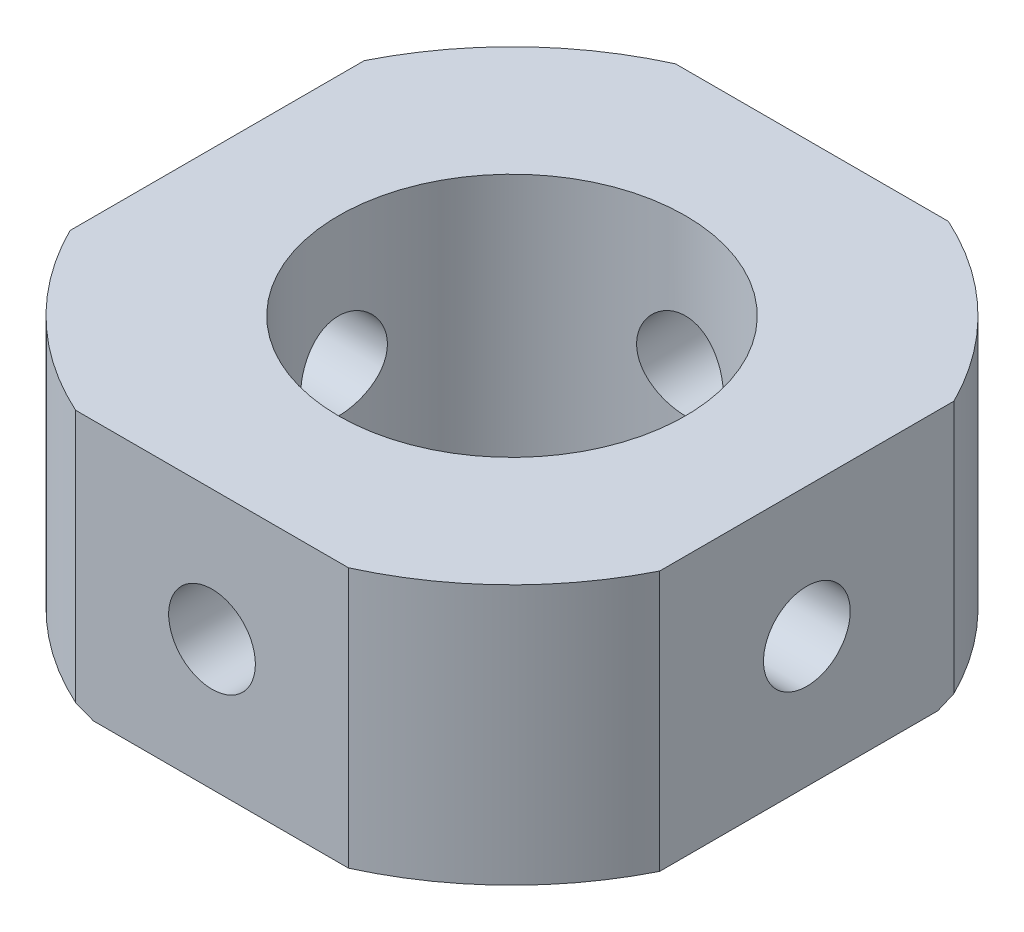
from build123d import *

# Parameters (mm, degrees)
SKETCH_1_R           = 9.5
EXTRUDE_1_DEPTH      = 3.75
SKETCH_2_R           = 5
CUT_EXTRUDE_1_DEPTH  = 16.386682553
SKETCH_3_OUTSIDE_W   = 26.58
SKETCH_3_OUTSIDE_H   = 26.58
SKETCH_3_OUTSIDE_W_2 = 17
SKETCH_3_OUTSIDE_H_2 = 17.295331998
CUT_EXTRUDE_2_DEPTH  = 16.386682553
HOLE_WIZARD_M3_1_D   = 2.5
CHAMFER_2_SIZE       = 0.2
HOLE_WIZARD_M3_2_D   = 2.5


with BuildPart() as part:
    # Sketch 1 → Extrude 1 (new, symmetric)
    with BuildSketch(Plane(origin=(0, 0, 0), x_dir=(1, 0, 0), z_dir=(0, 1, 0))):
        with Locations(Location((0, 0, 0), (0, 0, 270))):
            Circle(SKETCH_1_R)
    extrude(amount=EXTRUDE_1_DEPTH, both=True)

    # Sketch 2 → Cut-Extrude 1 (cut, through all)
    with BuildSketch(Plane(origin=(0, 3.75, 0), x_dir=(1, 0, 0), z_dir=(0, 1, 0))):
        with Locations(Location((0, 0, 0), (0, 0, 270))):
            Circle(SKETCH_2_R)
    extrude(amount=-CUT_EXTRUDE_1_DEPTH, mode=Mode.SUBTRACT)

    # Sketch 3 outside → Cut-Extrude 2 (cut, through all)
    with BuildSketch(Plane(origin=(0, 3.75, 0), x_dir=(1, 0, 0), z_dir=(0, 1, 0))):
        Rectangle(SKETCH_3_OUTSIDE_W, SKETCH_3_OUTSIDE_H)
        Rectangle(SKETCH_3_OUTSIDE_W_2, SKETCH_3_OUTSIDE_H_2, mode=Mode.SUBTRACT)
    extrude(amount=-CUT_EXTRUDE_2_DEPTH, mode=Mode.SUBTRACT)

    # Hole Wizard M3 _1 (through all)
    with Locations(Plane(origin=(8.5, 0, 0), x_dir=(0, 0, -1), z_dir=(1, 0, 0))):
        with Locations((0, 0)):
            Hole(HOLE_WIZARD_M3_1_D / 2)

    # Chamfer 2
    chamfer_2_edges = [part.edges().sort_by_distance(p)[0] for p in [
        (6.595107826, -3.75, -6.837730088),
        (-6.595107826, -3.75, 6.837730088),
    ]]
    chamfer(chamfer_2_edges, length=CHAMFER_2_SIZE)

    # Hole Wizard M3 _2 (through all)
    with Locations(Plane.XY.offset(8.647665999)):
        with Locations((0, 0)):
            Hole(HOLE_WIZARD_M3_2_D / 2)


solid = part.part
